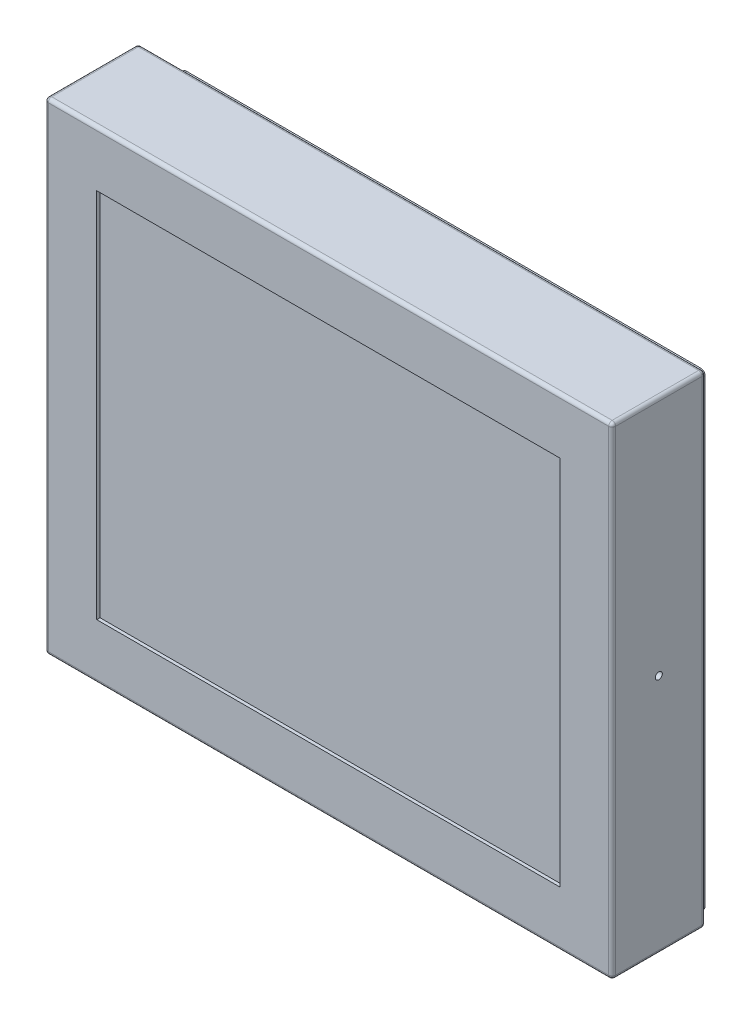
from build123d import *

# Parameters (mm, degrees)
ENCLOSURE_SIZE_W                    = 416.56
ENCLOSURE_SIZE_H                    = 354.076
ENCLOSURE_BODY_DEPTH                = 68.58
ENCLOSURE_RADII_R                   = 2.54
DISPLAY_SIZE_W                      = 340.36
DISPLAY_SIZE_H                      = 272.796
DISPLAY_OPENING_DEPTH               = 2.413
REAR_COVER_EMBOSS_DEPTH             = 4.7752
CP_CON_EMBOSS_DEPTH                 = 3.81
SKETCH18_R                          = 19.05
ELBOW_BASE_DEPTH                    = 6.35
SKETCH20_R                          = 12.319
SKETCH22_R                          = 22.86
ELBOW_NUT_DEPTH                     = 33.02
BUTTON_POSITION_W                   = 15.875
BUTTON_POSITION_H                   = 137.668
CONTROLS_BUTTONS_DEPTH              = 1.6002
F_100MM_VESA_PATTERN_D              = 3.3
F_100MM_VESA_PATTERN_DEPTH          = 16.002
F_100MM_VESA_PATTERN_TIP            = 0.991420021
F_1_4_20_KEYBOARD_MOUNT_HOLES_D     = 5.1054
F_1_4_20_KEYBOARD_MOUNT_HOLES_DEPTH = 15.875
F_1_4_20_KEYBOARD_MOUNT_HOLES_TIP   = 1.533816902


with BuildPart() as part:
    # Enclosure Size → Enclosure Body (new body)
    with BuildSketch(Plane.XY):
        Rectangle(ENCLOSURE_SIZE_W, ENCLOSURE_SIZE_H)
    extrude(amount=-ENCLOSURE_BODY_DEPTH)

    # Enclosure Radii
    enclosure_radii_edges = [part.edges().sort_by_distance(p)[0] for p in [
        (-208.28, 177.038, -34.29),
        (208.28, 177.038, -34.29),
        (0, 177.038, 0),
        (0, 177.038, -68.58),
        (208.28, -177.038, -34.29),
        (208.28, 0, 0),
        (208.28, 0, -68.58),
        (-208.28, -177.038, -34.29),
        (0, -177.038, 0),
        (0, -177.038, -68.58),
        (-208.28, 0, 0),
        (-208.28, 0, -68.58),
    ]]
    fillet(enclosure_radii_edges, radius=ENCLOSURE_RADII_R)

    # Display Size → Display Opening (cut)
    with BuildSketch(Plane.XY):
        Rectangle(DISPLAY_SIZE_W, DISPLAY_SIZE_H)
    extrude(amount=-DISPLAY_OPENING_DEPTH, mode=Mode.SUBTRACT)

    # Rear Cover Dimensions → Rear Cover Emboss (add)
    with BuildSketch(Plane(origin=(0, 0, -68.58), x_dir=(-1, 0, 0), z_dir=(0, 0, -1))):
        with BuildLine():
            Line((-200.025, 171.958), (177.673, 171.958))
            ThreePointArc((177.673, 171.958), (179.91806403, 171.02806403), (180.848, 168.783))
            Line((180.848, 168.783), (180.848, -168.783))
            ThreePointArc((180.848, -168.783), (179.91806403, -171.02806403), (177.673, -171.958))
            Line((177.673, -171.958), (-200.025, -171.958))
            ThreePointArc((-200.025, -171.958), (-202.27006403, -171.02806403), (-203.2, -168.783))
            Line((-203.2, -168.783), (-203.2, 168.783))
            ThreePointArc((-203.2, 168.783), (-202.27006403, 171.02806403), (-200.025, 171.958))
        make_face()
    extrude(amount=REAR_COVER_EMBOSS_DEPTH)

    # Cover Plate Position → CP-CON-_ _ Emboss (add)
    with BuildSketch(Plane(origin=(0, 0, -73.3552), x_dir=(-1, 0, 0), z_dir=(0, 0, -1))):
        with BuildLine():
            Line((-49.4792, -73.080492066), (158.877, -73.080492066))
            ThreePointArc((158.877, -73.080492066), (161.12206403, -74.010428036), (162.052, -76.255492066))
            Line((162.052, -76.255492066), (162.052, -168.6990149))
            ThreePointArc((162.052, -168.6990149), (161.12206403, -170.94407893), (158.877, -171.8740149))
            Line((158.877, -171.8740149), (-49.4792, -171.8740149))
            ThreePointArc((-49.4792, -171.8740149), (-51.72426403, -170.94407893), (-52.6542, -168.6990149))
            Line((-52.6542, -168.6990149), (-52.6542, -76.255492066))
            ThreePointArc((-52.6542, -76.255492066), (-51.72426403, -74.010428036), (-49.4792, -73.080492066))
        make_face()
    extrude(amount=CP_CON_EMBOSS_DEPTH)

    # Sketch18 → Elbow Base (add)
    with BuildSketch(Plane(origin=(0, 0, -77.1652), x_dir=(-1, 0, 0), z_dir=(0, 0, -1))):
        with Locations(Location((48.3362, -122.477253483, 0), (0, 0, 180))):
            Circle(SKETCH18_R)
    extrude(amount=ELBOW_BASE_DEPTH)

    # Elbow Neck: sweep along a path in Sketch21
    with BuildLine(Plane(origin=(0, -122.477253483, 0), x_dir=(1, 0, 0), z_dir=(0, 1, 0))) as elbow_neck_path:
        ThreePointArc((-48.3362, 83.5152), (-42.177019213, 100.958937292), (-25.4762, 108.9152))
    # Sketch20 → Elbow Neck (sweep)
    with BuildSketch(Plane(origin=(0, 0, -83.5152), x_dir=(-1, 0, 0), z_dir=(0, 0, -1))):
        with Locations((48.3362, -122.477253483)):
            Circle(SKETCH20_R)
    sweep(path=elbow_neck_path.line)

    # Sketch22 → Elbow Nut (add)
    with BuildSketch(Plane(origin=(-25.77770751, 0, -0.071406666), x_dir=(0.002770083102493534, 0, -0.9999961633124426), z_dir=(0.9999961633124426, 0, 0.002770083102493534))):
        with Locations((108.844210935, -122.477253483)):
            Circle(SKETCH22_R)
    extrude(amount=ELBOW_NUT_DEPTH)

    # Button Position → Controls Buttons (cut)
    with BuildSketch(Plane(origin=(0, 0, -68.58), x_dir=(-1, 0, 0), z_dir=(0, 0, -1))):
        with Locations((191.4525, 25.146)):
            Rectangle(BUTTON_POSITION_W, BUTTON_POSITION_H)
    extrude(amount=-CONTROLS_BUTTONS_DEPTH, mode=Mode.SUBTRACT)

    # 100mm VESA Pattern
    with Locations(Plane(origin=(0, 0, -73.3552), x_dir=(-1, 0, 0), z_dir=(0, 0, -1))):
        with Locations((-50.038, 49.962), (49.962, 49.962), (49.962, -50.038), (-50.038, -50.038)):
            Hole(F_100MM_VESA_PATTERN_D / 2, depth=F_100MM_VESA_PATTERN_DEPTH)
            with Locations((0, 0, -(F_100MM_VESA_PATTERN_DEPTH + F_100MM_VESA_PATTERN_TIP / 2))):  # 118° drill point
                Cone(0, F_100MM_VESA_PATTERN_D / 2, F_100MM_VESA_PATTERN_TIP, mode=Mode.SUBTRACT)

    # Sketch10 → 1_4-20 Yoke Mount Socket (revolve, cut)
    with BuildSketch(Plane(origin=(-208.28, 0, -34.29), x_dir=(0, 0, 1), z_dir=(0, 1, 0))):
        Polygon((0, 0), (0, 26.933816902), (2.5527, 25.4), (2.5527, 0), align=None)
    f_1_4_20_yoke_mount_socket = revolve(axis=Axis((-214.63, 0, -34.29), (1, 0, 0)), mode=Mode.SUBTRACT)

    # 1_4-20 Yoke Mount Mirrored: 1_4-20 Yoke Mount Socket across plane
    add(f_1_4_20_yoke_mount_socket.mirror(Plane(origin=(0, 0, 0), x_dir=(0, 0, 1), z_dir=(1, 0, 0))), mode=Mode.SUBTRACT)

    # 1_4-20 Keyboard Mount Holes
    with Locations(Plane(origin=(0, -177.038, 0), x_dir=(-1, 0, 0), z_dir=(0, -1, 0))):
        with Locations((177.782807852, 12.1412), (177.782807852, 48.8188), (-177.782807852, 48.8188), (-177.782807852, 12.1412)):
            Hole(F_1_4_20_KEYBOARD_MOUNT_HOLES_D / 2, depth=F_1_4_20_KEYBOARD_MOUNT_HOLES_DEPTH)
            with Locations((0, 0, -(F_1_4_20_KEYBOARD_MOUNT_HOLES_DEPTH + F_1_4_20_KEYBOARD_MOUNT_HOLES_TIP / 2))):  # 118° drill point
                Cone(0, F_1_4_20_KEYBOARD_MOUNT_HOLES_D / 2, F_1_4_20_KEYBOARD_MOUNT_HOLES_TIP, mode=Mode.SUBTRACT)


solid = part.part
